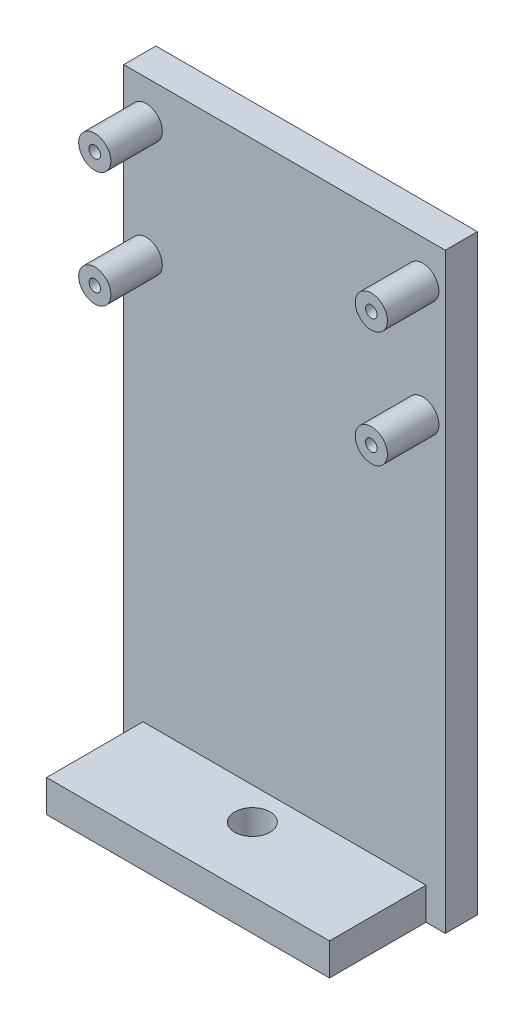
from build123d import *

# Parameters (mm, degrees)
SCHIZZO1_W                   = 50
SCHIZZO1_H                   = 92
ESTRUSIONE_ESTRUSIONE1_DEPTH = 5
SCHIZZO6_W                   = 44
SCHIZZO6_H                   = 5
ESTRUSIONE_ESTRUSIONE3_DEPTH = 15
FORO_PER_VITE_M5_1_D         = 5.5
FORO_PER_VITE_M1_6_1_D       = 1.8
SCHIZZO12_R                  = 2.5
ESTRUSIONE_ESTRUSIONE4_DEPTH = 8
FORO_PER_VITE_M1_6_2_D       = 1.8


with BuildPart() as part:
    # Schizzo1 → Estrusione-Estrusione1 (new body)
    with BuildSketch(Plane.XY):
        Rectangle(SCHIZZO1_W, SCHIZZO1_H)
    extrude(amount=ESTRUSIONE_ESTRUSIONE1_DEPTH)

    # Schizzo6 → Estrusione-Estrusione3 (add)
    with BuildSketch(Plane.XY.offset(5)):
        with Locations((0, -43.5)):
            Rectangle(SCHIZZO6_W, SCHIZZO6_H)
    extrude(amount=ESTRUSIONE_ESTRUSIONE3_DEPTH)

    # Foro per Vite M5-1 (through all)
    with Locations(Plane(origin=(0, -41, 0), x_dir=(1, 0, 0), z_dir=(0, 1, 0))):
        with Locations((0, -10)):
            Hole(FORO_PER_VITE_M5_1_D / 2)

    # Foro per Vite M1.6-1 (through all)
    with Locations(Plane.XY.offset(5)):
        with Locations((-21.5, 40), (21.5, 40), (21.5, 22), (-21.5, 22)):
            Hole(FORO_PER_VITE_M1_6_1_D / 2)

    # Schizzo12 → Estrusione-Estrusione4 (add)
    with BuildSketch(Plane.XY.offset(5)):
        with Locations((-21.5, 40)):
            Circle(SCHIZZO12_R)
        with Locations((-21.5, 22)):
            Circle(SCHIZZO12_R)
        with Locations((21.5, 40)):
            Circle(SCHIZZO12_R)
        with Locations((21.5, 22)):
            Circle(SCHIZZO12_R)
    extrude(amount=ESTRUSIONE_ESTRUSIONE4_DEPTH)

    # Foro per Vite M1.6-2 (through all)
    with Locations(Plane.XY.offset(13)):
        with Locations((-21.5, 40), (21.5, 40), (21.5, 22), (-21.5, 22)):
            Hole(FORO_PER_VITE_M1_6_2_D / 2)


solid = part.part
